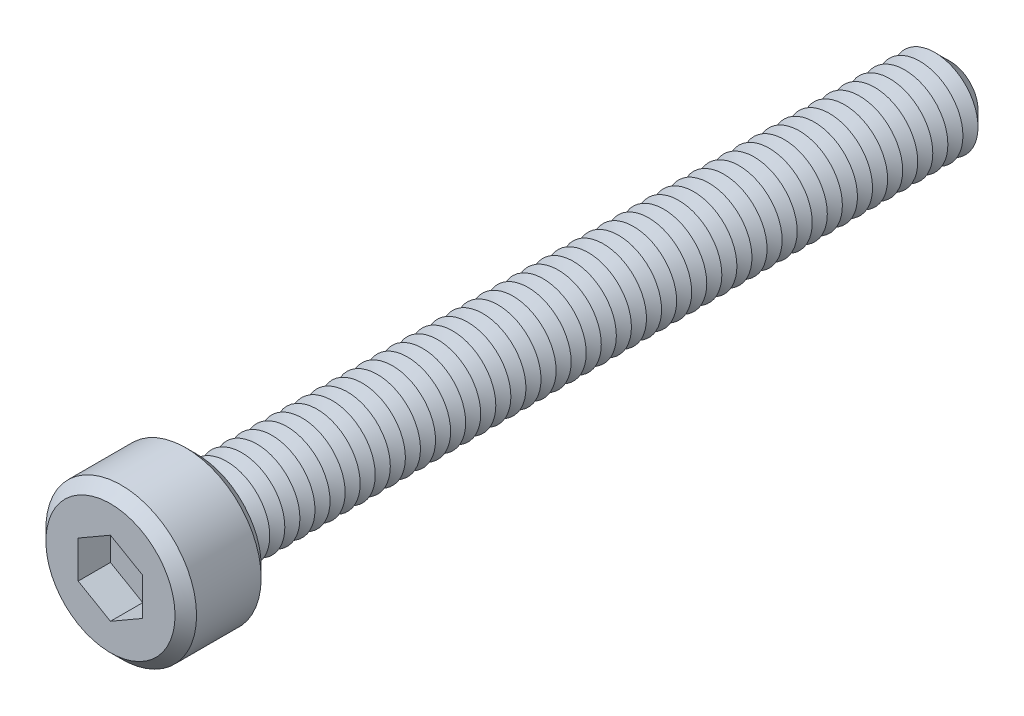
from build123d import *

# Parameters (mm, degrees)
SKETCH1_R           = 3.5
BOSS_EXTRUDE1_DEPTH = 4
SKETCH2_R           = 2
BOSS_EXTRUDE2_DEPTH = 35
CHAMFER1_SIZE       = 0.7
LPATTERN1_COUNT     = 49
LPATTERN1_PITCH     = 0.7
CUT_EXTRUDE1_DEPTH  = 1.5
SKETCH6_R           = 0.5
CUT_EXTRUDE2_DEPTH  = 37.5
CHAMFER2_SIZE       = 0.5


with BuildPart() as part:
    # Sketch1 → Boss-Extrude1 (new body)
    with BuildSketch(Plane.XY):
        Circle(SKETCH1_R)
    extrude(amount=BOSS_EXTRUDE1_DEPTH)

    # Sketch2 → Boss-Extrude2 (add)
    with BuildSketch(Plane(origin=(0, 0, 0), x_dir=(-1, 0, 0), z_dir=(0, 0, -1))):
        Circle(SKETCH2_R)
    extrude(amount=BOSS_EXTRUDE2_DEPTH)

    # Chamfer1
    chamfer1_edges = [part.edges().sort_by_distance(p)[0] for p in [
        (2, 0, -35),
    ]]
    chamfer(chamfer1_edges, length=CHAMFER1_SIZE)

    # Sketch4 → Cut-Revolve1 (revolve, cut)
    with BuildSketch(Plane(origin=(0, 0, 0), x_dir=(0, 0, -1), z_dir=(1, 0, 0)), mode=Mode.PRIVATE) as cut_revolve1_sk:
        Polygon((0, 2), (0.35, 1.393782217), (0.7, 2), align=None)
    cut_revolve1 = revolve(cut_revolve1_sk.sketch.rotate(Axis((0, 0, 2.512122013), (0, 0, -1)), 90), axis=Axis((0, 0, 2.512122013), (0, 0, -1)), mode=Mode.SUBTRACT)

    # LPattern1: Cut-Revolve1 ×49
    with Locations(*[(0, 0, -i * LPATTERN1_PITCH) for i in range(1, LPATTERN1_COUNT)]):
        add(cut_revolve1, mode=Mode.SUBTRACT)

    # Sketch5 → Cut-Extrude1 (cut)
    with BuildSketch(Plane.XY.offset(4)):
        Polygon((0, 1.732050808), (-1.5, 0.866025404), (-1.5, -0.866025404), (0, -1.732050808), (1.5, -0.866025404), (1.5, 0.866025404), align=None)
    extrude(amount=-CUT_EXTRUDE1_DEPTH, mode=Mode.SUBTRACT)

    # Sketch6 → Cut-Extrude2 (cut)
    with BuildSketch(Plane.XY.offset(2.5)):
        Circle(SKETCH6_R)
    extrude(amount=-CUT_EXTRUDE2_DEPTH, mode=Mode.SUBTRACT)

    # Chamfer2
    chamfer2_edges = [part.edges().sort_by_distance(p)[0] for p in [
        (-3.5, 0, 0),
        (-3.5, 0, 4),
    ]]
    chamfer(chamfer2_edges, length=CHAMFER2_SIZE)


solid = part.part
